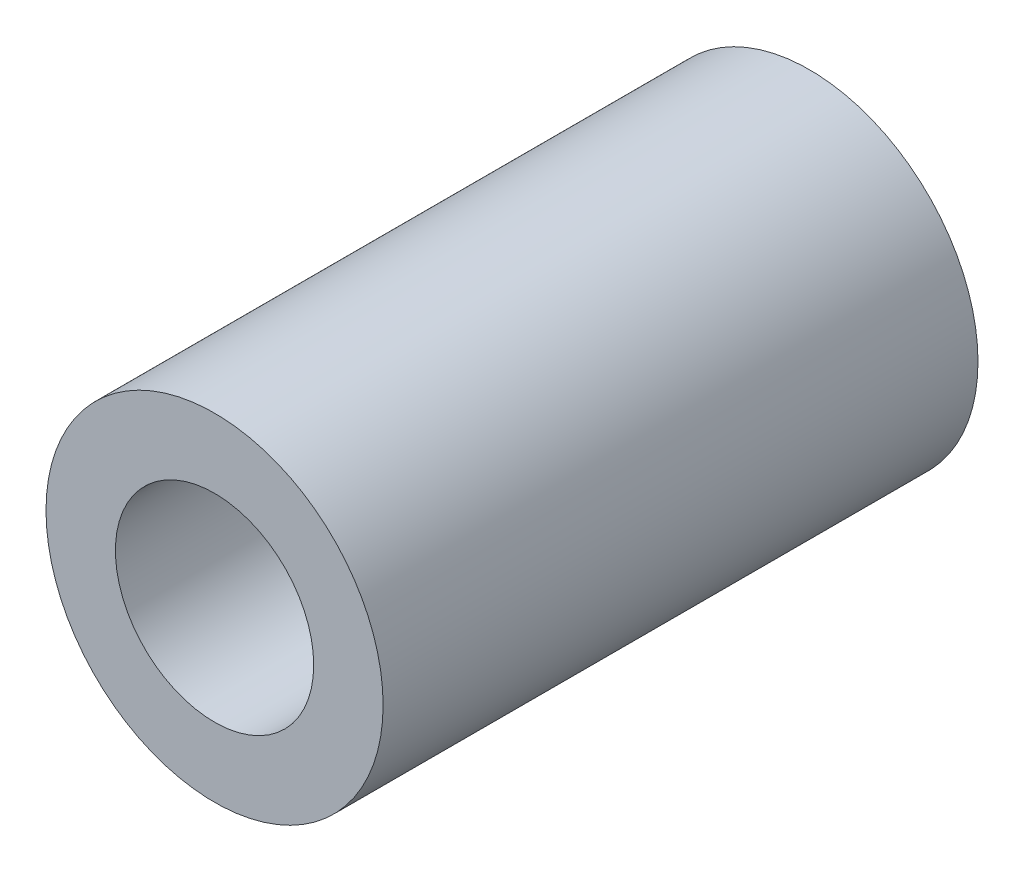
ISO-10303-21;
HEADER;
FILE_DESCRIPTION(('STEP AP214'),'2;1');
FILE_NAME('part.step','',(''),(''),'','','');
FILE_SCHEMA(('AUTOMOTIVE_DESIGN { 1 0 10303 214 1 1 1 1 }'));
ENDSEC;
DATA;
#1=APPLICATION_CONTEXT('core data for automotive mechanical design processes');
#2=APPLICATION_PROTOCOL_DEFINITION('international standard','automotive_design',2000,#1);
#3=PRODUCT_CONTEXT('',#1,'mechanical');
#4=PRODUCT('Part','Part','',(#3));
#5=PRODUCT_RELATED_PRODUCT_CATEGORY('part','',(#4));
#6=PRODUCT_DEFINITION_FORMATION('','',#4);
#7=PRODUCT_DEFINITION_CONTEXT('part definition',#1,'design');
#8=PRODUCT_DEFINITION('design','',#6,#7);
#9=PRODUCT_DEFINITION_SHAPE('','',#8);
#10=(LENGTH_UNIT() NAMED_UNIT(*) SI_UNIT(.MILLI.,.METRE.));
#11=(NAMED_UNIT(*) PLANE_ANGLE_UNIT() SI_UNIT($,.RADIAN.));
#12=(NAMED_UNIT(*) SI_UNIT($,.STERADIAN.) SOLID_ANGLE_UNIT());
#13=UNCERTAINTY_MEASURE_WITH_UNIT(LENGTH_MEASURE(1.E-05),#10,'distance_accuracy_value','');
#14=(GEOMETRIC_REPRESENTATION_CONTEXT(3) GLOBAL_UNCERTAINTY_ASSIGNED_CONTEXT((#13)) GLOBAL_UNIT_ASSIGNED_CONTEXT((#10,
#11,#12)) REPRESENTATION_CONTEXT('',''));
#15=CARTESIAN_POINT('',(0.,0.,0.));
#16=DIRECTION('',(0.,0.,1.));
#17=DIRECTION('',(1.,0.,0.));
#18=AXIS2_PLACEMENT_3D('',#15,#16,#17);
#19=CARTESIAN_POINT('',(0.,0.,30.));
#20=DIRECTION('',(0.,0.,1.));
#21=DIRECTION('',(1.,0.,0.));
#22=AXIS2_PLACEMENT_3D('',#19,#20,#21);
#23=PLANE('',#22);
#24=CARTESIAN_POINT('',(0.,0.,30.));
#25=DIRECTION('',(0.,0.,1.));
#26=DIRECTION('',(1.,0.,0.));
#27=AXIS2_PLACEMENT_3D('',#24,#25,#26);
#28=CIRCLE('',#27,8.5);
#29=CARTESIAN_POINT('',(8.5,0.,30.));
#30=VERTEX_POINT('',#29);
#31=EDGE_CURVE('E10',#30,#30,#28,.T.);
#32=ORIENTED_EDGE('',*,*,#31,.T.);
#33=EDGE_LOOP('',(#32));
#34=FACE_BOUND('',#33,.T.);
#35=CARTESIAN_POINT('',(0.,0.,30.));
#36=DIRECTION('',(0.,0.,1.));
#37=DIRECTION('',(1.,0.,0.));
#38=AXIS2_PLACEMENT_3D('',#35,#36,#37);
#39=CIRCLE('',#38,5.);
#40=CARTESIAN_POINT('',(5.,0.,30.));
#41=VERTEX_POINT('',#40);
#42=EDGE_CURVE('E43',#41,#41,#39,.T.);
#43=ORIENTED_EDGE('',*,*,#42,.F.);
#44=EDGE_LOOP('',(#43));
#45=FACE_BOUND('',#44,.T.);
#46=ADVANCED_FACE('F32',(#34,#45),#23,.T.);
#47=CARTESIAN_POINT('',(0.,0.,0.));
#48=DIRECTION('',(0.,0.,1.));
#49=DIRECTION('',(1.,0.,0.));
#50=AXIS2_PLACEMENT_3D('',#47,#48,#49);
#51=PLANE('',#50);
#52=CARTESIAN_POINT('',(0.,0.,0.));
#53=DIRECTION('',(0.,0.,1.));
#54=DIRECTION('',(1.,0.,0.));
#55=AXIS2_PLACEMENT_3D('',#52,#53,#54);
#56=CIRCLE('',#55,8.5);
#57=CARTESIAN_POINT('',(8.5,0.,0.));
#58=VERTEX_POINT('',#57);
#59=EDGE_CURVE('E39',#58,#58,#56,.T.);
#60=ORIENTED_EDGE('',*,*,#59,.F.);
#61=EDGE_LOOP('',(#60));
#62=FACE_BOUND('',#61,.T.);
#63=CARTESIAN_POINT('',(0.,0.,0.));
#64=DIRECTION('',(0.,0.,1.));
#65=DIRECTION('',(1.,0.,0.));
#66=AXIS2_PLACEMENT_3D('',#63,#64,#65);
#67=CIRCLE('',#66,5.);
#68=CARTESIAN_POINT('',(5.,0.,0.));
#69=VERTEX_POINT('',#68);
#70=EDGE_CURVE('E47',#69,#69,#67,.T.);
#71=ORIENTED_EDGE('',*,*,#70,.T.);
#72=EDGE_LOOP('',(#71));
#73=FACE_BOUND('',#72,.T.);
#74=ADVANCED_FACE('F53',(#62,#73),#51,.F.);
#75=CARTESIAN_POINT('',(0.,0.,30.));
#76=DIRECTION('',(0.,0.,-1.));
#77=DIRECTION('',(-1.,0.,0.));
#78=AXIS2_PLACEMENT_3D('',#75,#76,#77);
#79=CYLINDRICAL_SURFACE('',#78,8.5);
#80=ORIENTED_EDGE('',*,*,#31,.F.);
#81=EDGE_LOOP('',(#80));
#82=FACE_BOUND('',#81,.T.);
#83=ORIENTED_EDGE('',*,*,#59,.T.);
#84=EDGE_LOOP('',(#83));
#85=FACE_BOUND('',#84,.T.);
#86=ADVANCED_FACE('F34',(#82,#85),#79,.T.);
#87=CARTESIAN_POINT('',(0.,0.,30.));
#88=DIRECTION('',(0.,0.,-1.));
#89=DIRECTION('',(-1.,0.,0.));
#90=AXIS2_PLACEMENT_3D('',#87,#88,#89);
#91=CYLINDRICAL_SURFACE('',#90,5.);
#92=ORIENTED_EDGE('',*,*,#42,.T.);
#93=EDGE_LOOP('',(#92));
#94=FACE_BOUND('',#93,.T.);
#95=ORIENTED_EDGE('',*,*,#70,.F.);
#96=EDGE_LOOP('',(#95));
#97=FACE_BOUND('',#96,.T.);
#98=ADVANCED_FACE('F55',(#94,#97),#91,.F.);
#99=CLOSED_SHELL('',(#46,#74,#86,#98));
#100=MANIFOLD_SOLID_BREP('B2',#99);
#101=ADVANCED_BREP_SHAPE_REPRESENTATION('',(#18,#100),#14);
#102=SHAPE_DEFINITION_REPRESENTATION(#9,#101);
ENDSEC;
END-ISO-10303-21;
